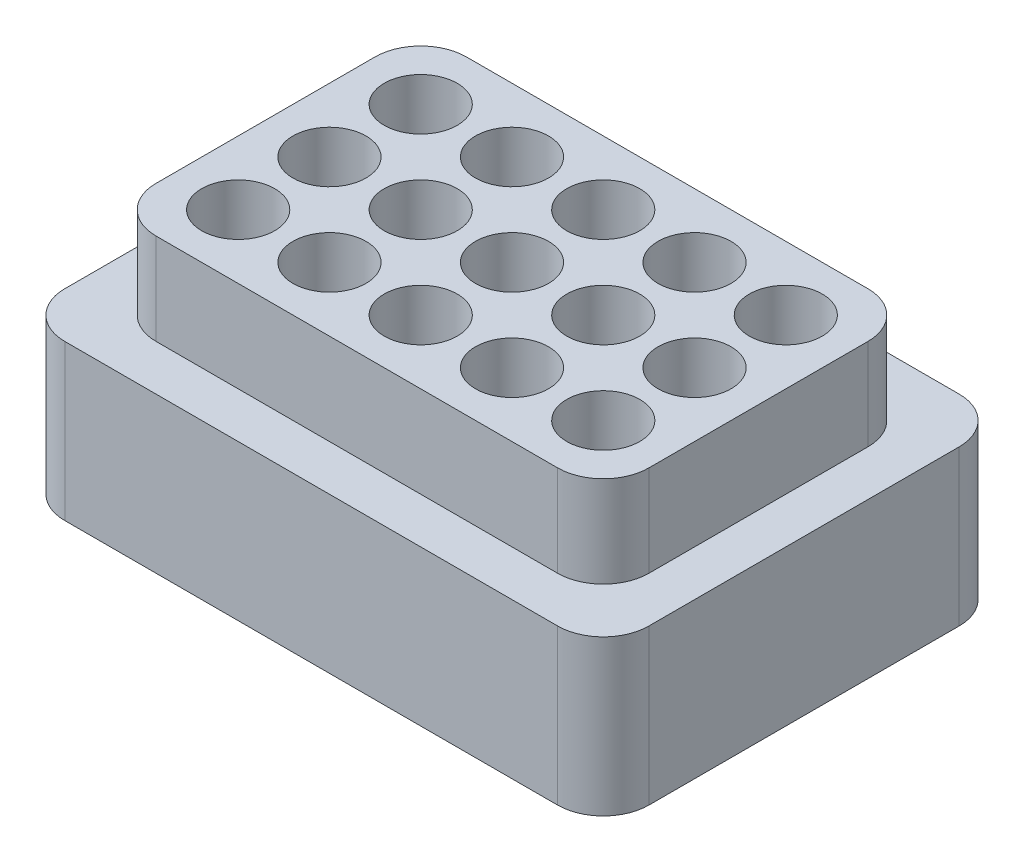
ISO-10303-21;
HEADER;
FILE_DESCRIPTION(('STEP AP214'),'2;1');
FILE_NAME('part.step','',(''),(''),'','','');
FILE_SCHEMA(('AUTOMOTIVE_DESIGN { 1 0 10303 214 1 1 1 1 }'));
ENDSEC;
DATA;
#1=APPLICATION_CONTEXT('core data for automotive mechanical design processes');
#2=APPLICATION_PROTOCOL_DEFINITION('international standard','automotive_design',2000,#1);
#3=PRODUCT_CONTEXT('',#1,'mechanical');
#4=PRODUCT('Part','Part','',(#3));
#5=PRODUCT_RELATED_PRODUCT_CATEGORY('part','',(#4));
#6=PRODUCT_DEFINITION_FORMATION('','',#4);
#7=PRODUCT_DEFINITION_CONTEXT('part definition',#1,'design');
#8=PRODUCT_DEFINITION('design','',#6,#7);
#9=PRODUCT_DEFINITION_SHAPE('','',#8);
#10=(LENGTH_UNIT() NAMED_UNIT(*) SI_UNIT(.MILLI.,.METRE.));
#11=(NAMED_UNIT(*) PLANE_ANGLE_UNIT() SI_UNIT($,.RADIAN.));
#12=(NAMED_UNIT(*) SI_UNIT($,.STERADIAN.) SOLID_ANGLE_UNIT());
#13=UNCERTAINTY_MEASURE_WITH_UNIT(LENGTH_MEASURE(1.E-05),#10,'distance_accuracy_value','');
#14=(GEOMETRIC_REPRESENTATION_CONTEXT(3) GLOBAL_UNCERTAINTY_ASSIGNED_CONTEXT((#13)) GLOBAL_UNIT_ASSIGNED_CONTEXT((#10,
#11,#12)) REPRESENTATION_CONTEXT('',''));
#15=CARTESIAN_POINT('',(0.,0.,0.));
#16=DIRECTION('',(0.,0.,1.));
#17=DIRECTION('',(1.,0.,0.));
#18=AXIS2_PLACEMENT_3D('',#15,#16,#17);
#19=CARTESIAN_POINT('',(0.,25.,0.));
#20=DIRECTION('',(0.,1.,0.));
#21=DIRECTION('',(0.,0.,1.));
#22=AXIS2_PLACEMENT_3D('',#19,#20,#21);
#23=PLANE('',#22);
#24=CARTESIAN_POINT('',(-16.8143652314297,25.,11.2679047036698));
#25=DIRECTION('',(0.,1.,0.));
#26=DIRECTION('',(0.,0.,1.));
#27=AXIS2_PLACEMENT_3D('',#24,#25,#26);
#28=CIRCLE('',#27,4.);
#29=CARTESIAN_POINT('',(-16.8143652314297,25.,15.2679047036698));
#30=VERTEX_POINT('',#29);
#31=EDGE_CURVE('E286',#30,#30,#28,.T.);
#32=ORIENTED_EDGE('',*,*,#31,.F.);
#33=EDGE_LOOP('',(#32));
#34=FACE_BOUND('',#33,.T.);
#35=CARTESIAN_POINT('',(23.1856347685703,25.,11.2679047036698));
#36=DIRECTION('',(0.,1.,0.));
#37=DIRECTION('',(0.,0.,1.));
#38=AXIS2_PLACEMENT_3D('',#35,#36,#37);
#39=CIRCLE('',#38,4.);
#40=CARTESIAN_POINT('',(23.1856347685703,25.,15.2679047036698));
#41=VERTEX_POINT('',#40);
#42=EDGE_CURVE('E298',#41,#41,#39,.T.);
#43=ORIENTED_EDGE('',*,*,#42,.F.);
#44=EDGE_LOOP('',(#43));
#45=FACE_BOUND('',#44,.T.);
#46=CARTESIAN_POINT('',(3.18563476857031,25.,11.2679047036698));
#47=DIRECTION('',(0.,1.,0.));
#48=DIRECTION('',(0.,0.,1.));
#49=AXIS2_PLACEMENT_3D('',#46,#47,#48);
#50=CIRCLE('',#49,4.);
#51=CARTESIAN_POINT('',(3.18563476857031,25.,15.2679047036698));
#52=VERTEX_POINT('',#51);
#53=EDGE_CURVE('E310',#52,#52,#50,.T.);
#54=ORIENTED_EDGE('',*,*,#53,.F.);
#55=EDGE_LOOP('',(#54));
#56=FACE_BOUND('',#55,.T.);
#57=CARTESIAN_POINT('',(23.1856347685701,25.,1.26790470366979));
#58=DIRECTION('',(0.,1.,0.));
#59=DIRECTION('',(0.,0.,1.));
#60=AXIS2_PLACEMENT_3D('',#57,#58,#59);
#61=CIRCLE('',#60,4.);
#62=CARTESIAN_POINT('',(23.1856347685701,25.,5.26790470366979));
#63=VERTEX_POINT('',#62);
#64=EDGE_CURVE('E322',#63,#63,#61,.T.);
#65=ORIENTED_EDGE('',*,*,#64,.F.);
#66=EDGE_LOOP('',(#65));
#67=FACE_BOUND('',#66,.T.);
#68=CARTESIAN_POINT('',(3.18563476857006,25.,1.26790470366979));
#69=DIRECTION('',(0.,1.,0.));
#70=DIRECTION('',(0.,0.,1.));
#71=AXIS2_PLACEMENT_3D('',#68,#69,#70);
#72=CIRCLE('',#71,4.);
#73=CARTESIAN_POINT('',(3.18563476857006,25.,5.26790470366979));
#74=VERTEX_POINT('',#73);
#75=EDGE_CURVE('E334',#74,#74,#72,.T.);
#76=ORIENTED_EDGE('',*,*,#75,.F.);
#77=EDGE_LOOP('',(#76));
#78=FACE_BOUND('',#77,.T.);
#79=CARTESIAN_POINT('',(23.1856347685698,25.,-8.73209529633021));
#80=DIRECTION('',(0.,1.,0.));
#81=DIRECTION('',(0.,0.,1.));
#82=AXIS2_PLACEMENT_3D('',#79,#80,#81);
#83=CIRCLE('',#82,4.);
#84=CARTESIAN_POINT('',(23.1856347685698,25.,-4.73209529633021));
#85=VERTEX_POINT('',#84);
#86=EDGE_CURVE('E346',#85,#85,#83,.T.);
#87=ORIENTED_EDGE('',*,*,#86,.F.);
#88=EDGE_LOOP('',(#87));
#89=FACE_BOUND('',#88,.T.);
#90=CARTESIAN_POINT('',(3.18563476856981,25.,-8.73209529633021));
#91=DIRECTION('',(0.,1.,0.));
#92=DIRECTION('',(0.,0.,1.));
#93=AXIS2_PLACEMENT_3D('',#90,#91,#92);
#94=CIRCLE('',#93,4.);
#95=CARTESIAN_POINT('',(3.18563476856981,25.,-4.73209529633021));
#96=VERTEX_POINT('',#95);
#97=EDGE_CURVE('E358',#96,#96,#94,.T.);
#98=ORIENTED_EDGE('',*,*,#97,.F.);
#99=EDGE_LOOP('',(#98));
#100=FACE_BOUND('',#99,.T.);
#101=CARTESIAN_POINT('',(-16.8143652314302,25.,-8.73209529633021));
#102=DIRECTION('',(0.,1.,0.));
#103=DIRECTION('',(0.,0.,1.));
#104=AXIS2_PLACEMENT_3D('',#101,#102,#103);
#105=CIRCLE('',#104,4.);
#106=CARTESIAN_POINT('',(-16.8143652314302,25.,-4.73209529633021));
#107=VERTEX_POINT('',#106);
#108=EDGE_CURVE('E178',#107,#107,#105,.T.);
#109=ORIENTED_EDGE('',*,*,#108,.F.);
#110=EDGE_LOOP('',(#109));
#111=FACE_BOUND('',#110,.T.);
#112=CARTESIAN_POINT('',(-6.81436523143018,25.,-8.73209529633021));
#113=DIRECTION('',(0.,1.,0.));
#114=DIRECTION('',(0.,0.,1.));
#115=AXIS2_PLACEMENT_3D('',#112,#113,#114);
#116=CIRCLE('',#115,4.);
#117=CARTESIAN_POINT('',(-6.81436523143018,25.,-4.73209529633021));
#118=VERTEX_POINT('',#117);
#119=EDGE_CURVE('E364',#118,#118,#116,.T.);
#120=ORIENTED_EDGE('',*,*,#119,.F.);
#121=EDGE_LOOP('',(#120));
#122=FACE_BOUND('',#121,.T.);
#123=CARTESIAN_POINT('',(13.1856347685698,25.,-8.73209529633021));
#124=DIRECTION('',(0.,1.,0.));
#125=DIRECTION('',(0.,0.,1.));
#126=AXIS2_PLACEMENT_3D('',#123,#124,#125);
#127=CIRCLE('',#126,4.);
#128=CARTESIAN_POINT('',(13.1856347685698,25.,-4.73209529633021));
#129=VERTEX_POINT('',#128);
#130=EDGE_CURVE('E352',#129,#129,#127,.T.);
#131=ORIENTED_EDGE('',*,*,#130,.F.);
#132=EDGE_LOOP('',(#131));
#133=FACE_BOUND('',#132,.T.);
#134=CARTESIAN_POINT('',(-6.81436523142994,25.,1.26790470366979));
#135=DIRECTION('',(0.,1.,0.));
#136=DIRECTION('',(0.,0.,1.));
#137=AXIS2_PLACEMENT_3D('',#134,#135,#136);
#138=CIRCLE('',#137,4.);
#139=CARTESIAN_POINT('',(-6.81436523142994,25.,5.26790470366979));
#140=VERTEX_POINT('',#139);
#141=EDGE_CURVE('E340',#140,#140,#138,.T.);
#142=ORIENTED_EDGE('',*,*,#141,.F.);
#143=EDGE_LOOP('',(#142));
#144=FACE_BOUND('',#143,.T.);
#145=CARTESIAN_POINT('',(13.1856347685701,25.,1.26790470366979));
#146=DIRECTION('',(0.,1.,0.));
#147=DIRECTION('',(0.,0.,1.));
#148=AXIS2_PLACEMENT_3D('',#145,#146,#147);
#149=CIRCLE('',#148,4.);
#150=CARTESIAN_POINT('',(13.1856347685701,25.,5.26790470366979));
#151=VERTEX_POINT('',#150);
#152=EDGE_CURVE('E328',#151,#151,#149,.T.);
#153=ORIENTED_EDGE('',*,*,#152,.F.);
#154=EDGE_LOOP('',(#153));
#155=FACE_BOUND('',#154,.T.);
#156=CARTESIAN_POINT('',(-6.81436523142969,25.,11.2679047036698));
#157=DIRECTION('',(0.,1.,0.));
#158=DIRECTION('',(0.,0.,1.));
#159=AXIS2_PLACEMENT_3D('',#156,#157,#158);
#160=CIRCLE('',#159,4.);
#161=CARTESIAN_POINT('',(-6.81436523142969,25.,15.2679047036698));
#162=VERTEX_POINT('',#161);
#163=EDGE_CURVE('E316',#162,#162,#160,.T.);
#164=ORIENTED_EDGE('',*,*,#163,.F.);
#165=EDGE_LOOP('',(#164));
#166=FACE_BOUND('',#165,.T.);
#167=CARTESIAN_POINT('',(13.1856347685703,25.,11.2679047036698));
#168=DIRECTION('',(0.,1.,0.));
#169=DIRECTION('',(0.,0.,1.));
#170=AXIS2_PLACEMENT_3D('',#167,#168,#169);
#171=CIRCLE('',#170,4.);
#172=CARTESIAN_POINT('',(13.1856347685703,25.,15.2679047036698));
#173=VERTEX_POINT('',#172);
#174=EDGE_CURVE('E304',#173,#173,#171,.T.);
#175=ORIENTED_EDGE('',*,*,#174,.F.);
#176=EDGE_LOOP('',(#175));
#177=FACE_BOUND('',#176,.T.);
#178=CARTESIAN_POINT('',(-16.8143652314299,25.,1.26790470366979));
#179=DIRECTION('',(0.,1.,0.));
#180=DIRECTION('',(0.,0.,1.));
#181=AXIS2_PLACEMENT_3D('',#178,#179,#180);
#182=CIRCLE('',#181,4.);
#183=CARTESIAN_POINT('',(-16.8143652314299,25.,5.26790470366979));
#184=VERTEX_POINT('',#183);
#185=EDGE_CURVE('E292',#184,#184,#182,.T.);
#186=ORIENTED_EDGE('',*,*,#185,.F.);
#187=EDGE_LOOP('',(#186));
#188=FACE_BOUND('',#187,.T.);
#189=DIRECTION('',(-1.,0.,0.));
#190=VECTOR('',#189,1.);
#191=CARTESIAN_POINT('',(30.1856347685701,25.,-15.7320952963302));
#192=LINE('',#191,#190);
#193=CARTESIAN_POINT('',(25.1856347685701,25.,-15.7320952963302));
#194=VERTEX_POINT('',#193);
#195=CARTESIAN_POINT('',(-18.8143652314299,25.,-15.7320952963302));
#196=VERTEX_POINT('',#195);
#197=EDGE_CURVE('E251',#194,#196,#192,.T.);
#198=ORIENTED_EDGE('',*,*,#197,.T.);
#199=CARTESIAN_POINT('',(-18.8143652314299,25.,-10.7320952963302));
#200=DIRECTION('',(0.,1.,0.));
#201=DIRECTION('',(0.,0.,1.));
#202=AXIS2_PLACEMENT_3D('',#199,#200,#201);
#203=CIRCLE('',#202,5.);
#204=CARTESIAN_POINT('',(-23.8143652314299,25.,-10.7320952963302));
#205=VERTEX_POINT('',#204);
#206=EDGE_CURVE('E204',#196,#205,#203,.T.);
#207=ORIENTED_EDGE('',*,*,#206,.T.);
#208=DIRECTION('',(0.,0.,1.));
#209=VECTOR('',#208,1.);
#210=CARTESIAN_POINT('',(-23.8143652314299,25.,-15.7320952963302));
#211=LINE('',#210,#209);
#212=CARTESIAN_POINT('',(-23.8143652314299,25.,13.2679047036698));
#213=VERTEX_POINT('',#212);
#214=EDGE_CURVE('E257',#205,#213,#211,.T.);
#215=ORIENTED_EDGE('',*,*,#214,.T.);
#216=CARTESIAN_POINT('',(-18.8143652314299,25.,13.2679047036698));
#217=DIRECTION('',(0.,1.,0.));
#218=DIRECTION('',(0.,0.,1.));
#219=AXIS2_PLACEMENT_3D('',#216,#217,#218);
#220=CIRCLE('',#219,5.);
#221=CARTESIAN_POINT('',(-18.8143652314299,25.,18.2679047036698));
#222=VERTEX_POINT('',#221);
#223=EDGE_CURVE('E201',#213,#222,#220,.T.);
#224=ORIENTED_EDGE('',*,*,#223,.T.);
#225=DIRECTION('',(1.,0.,0.));
#226=VECTOR('',#225,1.);
#227=CARTESIAN_POINT('',(-23.8143652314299,25.,18.2679047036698));
#228=LINE('',#227,#226);
#229=CARTESIAN_POINT('',(25.1856347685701,25.,18.2679047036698));
#230=VERTEX_POINT('',#229);
#231=EDGE_CURVE('E256',#222,#230,#228,.T.);
#232=ORIENTED_EDGE('',*,*,#231,.T.);
#233=CARTESIAN_POINT('',(25.1856347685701,25.,13.2679047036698));
#234=DIRECTION('',(0.,1.,0.));
#235=DIRECTION('',(0.,0.,1.));
#236=AXIS2_PLACEMENT_3D('',#233,#234,#235);
#237=CIRCLE('',#236,5.);
#238=CARTESIAN_POINT('',(30.1856347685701,25.,13.2679047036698));
#239=VERTEX_POINT('',#238);
#240=EDGE_CURVE('E56',#230,#239,#237,.T.);
#241=ORIENTED_EDGE('',*,*,#240,.T.);
#242=DIRECTION('',(0.,0.,-1.));
#243=VECTOR('',#242,1.);
#244=CARTESIAN_POINT('',(30.1856347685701,25.,18.2679047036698));
#245=LINE('',#244,#243);
#246=CARTESIAN_POINT('',(30.1856347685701,25.,-10.7320952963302));
#247=VERTEX_POINT('',#246);
#248=EDGE_CURVE('E261',#239,#247,#245,.T.);
#249=ORIENTED_EDGE('',*,*,#248,.T.);
#250=CARTESIAN_POINT('',(25.1856347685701,25.,-10.7320952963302));
#251=DIRECTION('',(0.,1.,0.));
#252=DIRECTION('',(0.,0.,1.));
#253=AXIS2_PLACEMENT_3D('',#250,#251,#252);
#254=CIRCLE('',#253,5.);
#255=EDGE_CURVE('E48',#247,#194,#254,.T.);
#256=ORIENTED_EDGE('',*,*,#255,.T.);
#257=EDGE_LOOP('',(#198,#207,#215,#224,#232,#241,#249,#256));
#258=FACE_BOUND('',#257,.T.);
#259=ADVANCED_FACE('F33',(#34,#45,#56,#67,#78,#89,#100,#111,#122,#133,#144,#155,#166,#177,#188,
#258),#23,.T.);
#260=CARTESIAN_POINT('',(-16.8143652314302,25.,-8.73209529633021));
#261=DIRECTION('',(0.,-1.,0.));
#262=DIRECTION('',(0.,0.,-1.));
#263=AXIS2_PLACEMENT_3D('',#260,#261,#262);
#264=CYLINDRICAL_SURFACE('',#263,4.);
#265=ORIENTED_EDGE('',*,*,#108,.T.);
#266=EDGE_LOOP('',(#265));
#267=FACE_BOUND('',#266,.T.);
#268=CARTESIAN_POINT('',(-16.8143652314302,0.,-8.73209529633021));
#269=DIRECTION('',(0.,1.,0.));
#270=DIRECTION('',(0.,0.,1.));
#271=AXIS2_PLACEMENT_3D('',#268,#269,#270);
#272=CIRCLE('',#271,4.);
#273=CARTESIAN_POINT('',(-16.8143652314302,0.,-4.73209529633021));
#274=VERTEX_POINT('',#273);
#275=EDGE_CURVE('E367',#274,#274,#272,.T.);
#276=ORIENTED_EDGE('',*,*,#275,.F.);
#277=EDGE_LOOP('',(#276));
#278=FACE_BOUND('',#277,.T.);
#279=ADVANCED_FACE('F376',(#267,#278),#264,.F.);
#280=CARTESIAN_POINT('',(-6.81436523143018,25.,-8.73209529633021));
#281=DIRECTION('',(0.,-1.,0.));
#282=DIRECTION('',(0.,0.,-1.));
#283=AXIS2_PLACEMENT_3D('',#280,#281,#282);
#284=CYLINDRICAL_SURFACE('',#283,4.);
#285=ORIENTED_EDGE('',*,*,#119,.T.);
#286=EDGE_LOOP('',(#285));
#287=FACE_BOUND('',#286,.T.);
#288=CARTESIAN_POINT('',(-6.81436523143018,0.,-8.73209529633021));
#289=DIRECTION('',(0.,1.,0.));
#290=DIRECTION('',(0.,0.,1.));
#291=AXIS2_PLACEMENT_3D('',#288,#289,#290);
#292=CIRCLE('',#291,4.);
#293=CARTESIAN_POINT('',(-6.81436523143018,0.,-4.73209529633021));
#294=VERTEX_POINT('',#293);
#295=EDGE_CURVE('E361',#294,#294,#292,.T.);
#296=ORIENTED_EDGE('',*,*,#295,.F.);
#297=EDGE_LOOP('',(#296));
#298=FACE_BOUND('',#297,.T.);
#299=ADVANCED_FACE('F378',(#287,#298),#284,.F.);
#300=CARTESIAN_POINT('',(3.18563476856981,25.,-8.73209529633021));
#301=DIRECTION('',(0.,-1.,0.));
#302=DIRECTION('',(0.,0.,-1.));
#303=AXIS2_PLACEMENT_3D('',#300,#301,#302);
#304=CYLINDRICAL_SURFACE('',#303,4.);
#305=ORIENTED_EDGE('',*,*,#97,.T.);
#306=EDGE_LOOP('',(#305));
#307=FACE_BOUND('',#306,.T.);
#308=CARTESIAN_POINT('',(3.18563476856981,0.,-8.73209529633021));
#309=DIRECTION('',(0.,1.,0.));
#310=DIRECTION('',(0.,0.,1.));
#311=AXIS2_PLACEMENT_3D('',#308,#309,#310);
#312=CIRCLE('',#311,4.);
#313=CARTESIAN_POINT('',(3.18563476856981,0.,-4.73209529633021));
#314=VERTEX_POINT('',#313);
#315=EDGE_CURVE('E355',#314,#314,#312,.T.);
#316=ORIENTED_EDGE('',*,*,#315,.F.);
#317=EDGE_LOOP('',(#316));
#318=FACE_BOUND('',#317,.T.);
#319=ADVANCED_FACE('F385',(#307,#318),#304,.F.);
#320=CARTESIAN_POINT('',(13.1856347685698,25.,-8.73209529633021));
#321=DIRECTION('',(0.,-1.,0.));
#322=DIRECTION('',(0.,0.,-1.));
#323=AXIS2_PLACEMENT_3D('',#320,#321,#322);
#324=CYLINDRICAL_SURFACE('',#323,4.);
#325=ORIENTED_EDGE('',*,*,#130,.T.);
#326=EDGE_LOOP('',(#325));
#327=FACE_BOUND('',#326,.T.);
#328=CARTESIAN_POINT('',(13.1856347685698,0.,-8.73209529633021));
#329=DIRECTION('',(0.,1.,0.));
#330=DIRECTION('',(0.,0.,1.));
#331=AXIS2_PLACEMENT_3D('',#328,#329,#330);
#332=CIRCLE('',#331,4.);
#333=CARTESIAN_POINT('',(13.1856347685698,0.,-4.73209529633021));
#334=VERTEX_POINT('',#333);
#335=EDGE_CURVE('E349',#334,#334,#332,.T.);
#336=ORIENTED_EDGE('',*,*,#335,.F.);
#337=EDGE_LOOP('',(#336));
#338=FACE_BOUND('',#337,.T.);
#339=ADVANCED_FACE('F502',(#327,#338),#324,.F.);
#340=CARTESIAN_POINT('',(23.1856347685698,25.,-8.73209529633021));
#341=DIRECTION('',(0.,-1.,0.));
#342=DIRECTION('',(0.,0.,-1.));
#343=AXIS2_PLACEMENT_3D('',#340,#341,#342);
#344=CYLINDRICAL_SURFACE('',#343,4.);
#345=ORIENTED_EDGE('',*,*,#86,.T.);
#346=EDGE_LOOP('',(#345));
#347=FACE_BOUND('',#346,.T.);
#348=CARTESIAN_POINT('',(23.1856347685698,0.,-8.73209529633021));
#349=DIRECTION('',(0.,1.,0.));
#350=DIRECTION('',(0.,0.,1.));
#351=AXIS2_PLACEMENT_3D('',#348,#349,#350);
#352=CIRCLE('',#351,4.);
#353=CARTESIAN_POINT('',(23.1856347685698,0.,-4.73209529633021));
#354=VERTEX_POINT('',#353);
#355=EDGE_CURVE('E343',#354,#354,#352,.T.);
#356=ORIENTED_EDGE('',*,*,#355,.F.);
#357=EDGE_LOOP('',(#356));
#358=FACE_BOUND('',#357,.T.);
#359=ADVANCED_FACE('F498',(#347,#358),#344,.F.);
#360=CARTESIAN_POINT('',(-6.81436523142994,25.,1.26790470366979));
#361=DIRECTION('',(0.,-1.,0.));
#362=DIRECTION('',(0.,0.,-1.));
#363=AXIS2_PLACEMENT_3D('',#360,#361,#362);
#364=CYLINDRICAL_SURFACE('',#363,4.);
#365=ORIENTED_EDGE('',*,*,#141,.T.);
#366=EDGE_LOOP('',(#365));
#367=FACE_BOUND('',#366,.T.);
#368=CARTESIAN_POINT('',(-6.81436523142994,0.,1.26790470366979));
#369=DIRECTION('',(0.,1.,0.));
#370=DIRECTION('',(0.,0.,1.));
#371=AXIS2_PLACEMENT_3D('',#368,#369,#370);
#372=CIRCLE('',#371,4.);
#373=CARTESIAN_POINT('',(-6.81436523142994,0.,5.26790470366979));
#374=VERTEX_POINT('',#373);
#375=EDGE_CURVE('E337',#374,#374,#372,.T.);
#376=ORIENTED_EDGE('',*,*,#375,.F.);
#377=EDGE_LOOP('',(#376));
#378=FACE_BOUND('',#377,.T.);
#379=ADVANCED_FACE('F494',(#367,#378),#364,.F.);
#380=CARTESIAN_POINT('',(3.18563476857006,25.,1.26790470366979));
#381=DIRECTION('',(0.,-1.,0.));
#382=DIRECTION('',(0.,0.,-1.));
#383=AXIS2_PLACEMENT_3D('',#380,#381,#382);
#384=CYLINDRICAL_SURFACE('',#383,4.);
#385=ORIENTED_EDGE('',*,*,#75,.T.);
#386=EDGE_LOOP('',(#385));
#387=FACE_BOUND('',#386,.T.);
#388=CARTESIAN_POINT('',(3.18563476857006,0.,1.26790470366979));
#389=DIRECTION('',(0.,1.,0.));
#390=DIRECTION('',(0.,0.,1.));
#391=AXIS2_PLACEMENT_3D('',#388,#389,#390);
#392=CIRCLE('',#391,4.);
#393=CARTESIAN_POINT('',(3.18563476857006,0.,5.26790470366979));
#394=VERTEX_POINT('',#393);
#395=EDGE_CURVE('E331',#394,#394,#392,.T.);
#396=ORIENTED_EDGE('',*,*,#395,.F.);
#397=EDGE_LOOP('',(#396));
#398=FACE_BOUND('',#397,.T.);
#399=ADVANCED_FACE('F490',(#387,#398),#384,.F.);
#400=CARTESIAN_POINT('',(13.1856347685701,25.,1.26790470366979));
#401=DIRECTION('',(0.,-1.,0.));
#402=DIRECTION('',(0.,0.,-1.));
#403=AXIS2_PLACEMENT_3D('',#400,#401,#402);
#404=CYLINDRICAL_SURFACE('',#403,4.);
#405=ORIENTED_EDGE('',*,*,#152,.T.);
#406=EDGE_LOOP('',(#405));
#407=FACE_BOUND('',#406,.T.);
#408=CARTESIAN_POINT('',(13.1856347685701,0.,1.26790470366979));
#409=DIRECTION('',(0.,1.,0.));
#410=DIRECTION('',(0.,0.,1.));
#411=AXIS2_PLACEMENT_3D('',#408,#409,#410);
#412=CIRCLE('',#411,4.);
#413=CARTESIAN_POINT('',(13.1856347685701,0.,5.26790470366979));
#414=VERTEX_POINT('',#413);
#415=EDGE_CURVE('E325',#414,#414,#412,.T.);
#416=ORIENTED_EDGE('',*,*,#415,.F.);
#417=EDGE_LOOP('',(#416));
#418=FACE_BOUND('',#417,.T.);
#419=ADVANCED_FACE('F486',(#407,#418),#404,.F.);
#420=CARTESIAN_POINT('',(23.1856347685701,25.,1.26790470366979));
#421=DIRECTION('',(0.,-1.,0.));
#422=DIRECTION('',(0.,0.,-1.));
#423=AXIS2_PLACEMENT_3D('',#420,#421,#422);
#424=CYLINDRICAL_SURFACE('',#423,4.);
#425=ORIENTED_EDGE('',*,*,#64,.T.);
#426=EDGE_LOOP('',(#425));
#427=FACE_BOUND('',#426,.T.);
#428=CARTESIAN_POINT('',(23.1856347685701,0.,1.26790470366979));
#429=DIRECTION('',(0.,1.,0.));
#430=DIRECTION('',(0.,0.,1.));
#431=AXIS2_PLACEMENT_3D('',#428,#429,#430);
#432=CIRCLE('',#431,4.);
#433=CARTESIAN_POINT('',(23.1856347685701,0.,5.26790470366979));
#434=VERTEX_POINT('',#433);
#435=EDGE_CURVE('E319',#434,#434,#432,.T.);
#436=ORIENTED_EDGE('',*,*,#435,.F.);
#437=EDGE_LOOP('',(#436));
#438=FACE_BOUND('',#437,.T.);
#439=ADVANCED_FACE('F482',(#427,#438),#424,.F.);
#440=CARTESIAN_POINT('',(-6.81436523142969,25.,11.2679047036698));
#441=DIRECTION('',(0.,-1.,0.));
#442=DIRECTION('',(0.,0.,-1.));
#443=AXIS2_PLACEMENT_3D('',#440,#441,#442);
#444=CYLINDRICAL_SURFACE('',#443,4.);
#445=ORIENTED_EDGE('',*,*,#163,.T.);
#446=EDGE_LOOP('',(#445));
#447=FACE_BOUND('',#446,.T.);
#448=CARTESIAN_POINT('',(-6.81436523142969,0.,11.2679047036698));
#449=DIRECTION('',(0.,1.,0.));
#450=DIRECTION('',(0.,0.,1.));
#451=AXIS2_PLACEMENT_3D('',#448,#449,#450);
#452=CIRCLE('',#451,4.);
#453=CARTESIAN_POINT('',(-6.81436523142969,0.,15.2679047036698));
#454=VERTEX_POINT('',#453);
#455=EDGE_CURVE('E313',#454,#454,#452,.T.);
#456=ORIENTED_EDGE('',*,*,#455,.F.);
#457=EDGE_LOOP('',(#456));
#458=FACE_BOUND('',#457,.T.);
#459=ADVANCED_FACE('F478',(#447,#458),#444,.F.);
#460=CARTESIAN_POINT('',(3.18563476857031,25.,11.2679047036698));
#461=DIRECTION('',(0.,-1.,0.));
#462=DIRECTION('',(0.,0.,-1.));
#463=AXIS2_PLACEMENT_3D('',#460,#461,#462);
#464=CYLINDRICAL_SURFACE('',#463,4.);
#465=ORIENTED_EDGE('',*,*,#53,.T.);
#466=EDGE_LOOP('',(#465));
#467=FACE_BOUND('',#466,.T.);
#468=CARTESIAN_POINT('',(3.18563476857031,0.,11.2679047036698));
#469=DIRECTION('',(0.,1.,0.));
#470=DIRECTION('',(0.,0.,1.));
#471=AXIS2_PLACEMENT_3D('',#468,#469,#470);
#472=CIRCLE('',#471,4.);
#473=CARTESIAN_POINT('',(3.18563476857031,0.,15.2679047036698));
#474=VERTEX_POINT('',#473);
#475=EDGE_CURVE('E307',#474,#474,#472,.T.);
#476=ORIENTED_EDGE('',*,*,#475,.F.);
#477=EDGE_LOOP('',(#476));
#478=FACE_BOUND('',#477,.T.);
#479=ADVANCED_FACE('F474',(#467,#478),#464,.F.);
#480=CARTESIAN_POINT('',(13.1856347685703,25.,11.2679047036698));
#481=DIRECTION('',(0.,-1.,0.));
#482=DIRECTION('',(0.,0.,-1.));
#483=AXIS2_PLACEMENT_3D('',#480,#481,#482);
#484=CYLINDRICAL_SURFACE('',#483,4.);
#485=ORIENTED_EDGE('',*,*,#174,.T.);
#486=EDGE_LOOP('',(#485));
#487=FACE_BOUND('',#486,.T.);
#488=CARTESIAN_POINT('',(13.1856347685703,0.,11.2679047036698));
#489=DIRECTION('',(0.,1.,0.));
#490=DIRECTION('',(0.,0.,1.));
#491=AXIS2_PLACEMENT_3D('',#488,#489,#490);
#492=CIRCLE('',#491,4.);
#493=CARTESIAN_POINT('',(13.1856347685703,0.,15.2679047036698));
#494=VERTEX_POINT('',#493);
#495=EDGE_CURVE('E301',#494,#494,#492,.T.);
#496=ORIENTED_EDGE('',*,*,#495,.F.);
#497=EDGE_LOOP('',(#496));
#498=FACE_BOUND('',#497,.T.);
#499=ADVANCED_FACE('F470',(#487,#498),#484,.F.);
#500=CARTESIAN_POINT('',(23.1856347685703,25.,11.2679047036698));
#501=DIRECTION('',(0.,-1.,0.));
#502=DIRECTION('',(0.,0.,-1.));
#503=AXIS2_PLACEMENT_3D('',#500,#501,#502);
#504=CYLINDRICAL_SURFACE('',#503,4.);
#505=ORIENTED_EDGE('',*,*,#42,.T.);
#506=EDGE_LOOP('',(#505));
#507=FACE_BOUND('',#506,.T.);
#508=CARTESIAN_POINT('',(23.1856347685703,0.,11.2679047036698));
#509=DIRECTION('',(0.,1.,0.));
#510=DIRECTION('',(0.,0.,1.));
#511=AXIS2_PLACEMENT_3D('',#508,#509,#510);
#512=CIRCLE('',#511,4.);
#513=CARTESIAN_POINT('',(23.1856347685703,0.,15.2679047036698));
#514=VERTEX_POINT('',#513);
#515=EDGE_CURVE('E295',#514,#514,#512,.T.);
#516=ORIENTED_EDGE('',*,*,#515,.F.);
#517=EDGE_LOOP('',(#516));
#518=FACE_BOUND('',#517,.T.);
#519=ADVANCED_FACE('F466',(#507,#518),#504,.F.);
#520=CARTESIAN_POINT('',(-16.8143652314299,25.,1.26790470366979));
#521=DIRECTION('',(0.,-1.,0.));
#522=DIRECTION('',(0.,0.,-1.));
#523=AXIS2_PLACEMENT_3D('',#520,#521,#522);
#524=CYLINDRICAL_SURFACE('',#523,4.);
#525=ORIENTED_EDGE('',*,*,#185,.T.);
#526=EDGE_LOOP('',(#525));
#527=FACE_BOUND('',#526,.T.);
#528=CARTESIAN_POINT('',(-16.8143652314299,0.,1.26790470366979));
#529=DIRECTION('',(0.,1.,0.));
#530=DIRECTION('',(0.,0.,1.));
#531=AXIS2_PLACEMENT_3D('',#528,#529,#530);
#532=CIRCLE('',#531,4.);
#533=CARTESIAN_POINT('',(-16.8143652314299,0.,5.26790470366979));
#534=VERTEX_POINT('',#533);
#535=EDGE_CURVE('E289',#534,#534,#532,.T.);
#536=ORIENTED_EDGE('',*,*,#535,.F.);
#537=EDGE_LOOP('',(#536));
#538=FACE_BOUND('',#537,.T.);
#539=ADVANCED_FACE('F462',(#527,#538),#524,.F.);
#540=CARTESIAN_POINT('',(-16.8143652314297,25.,11.2679047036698));
#541=DIRECTION('',(0.,-1.,0.));
#542=DIRECTION('',(0.,0.,-1.));
#543=AXIS2_PLACEMENT_3D('',#540,#541,#542);
#544=CYLINDRICAL_SURFACE('',#543,4.);
#545=ORIENTED_EDGE('',*,*,#31,.T.);
#546=EDGE_LOOP('',(#545));
#547=FACE_BOUND('',#546,.T.);
#548=CARTESIAN_POINT('',(-16.8143652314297,0.,11.2679047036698));
#549=DIRECTION('',(0.,1.,0.));
#550=DIRECTION('',(0.,0.,1.));
#551=AXIS2_PLACEMENT_3D('',#548,#549,#550);
#552=CIRCLE('',#551,4.);
#553=CARTESIAN_POINT('',(-16.8143652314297,0.,15.2679047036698));
#554=VERTEX_POINT('',#553);
#555=EDGE_CURVE('E285',#554,#554,#552,.T.);
#556=ORIENTED_EDGE('',*,*,#555,.F.);
#557=EDGE_LOOP('',(#556));
#558=FACE_BOUND('',#557,.T.);
#559=ADVANCED_FACE('F459',(#547,#558),#544,.F.);
#560=CARTESIAN_POINT('',(0.,0.,0.));
#561=DIRECTION('',(0.,1.,0.));
#562=DIRECTION('',(0.,0.,1.));
#563=AXIS2_PLACEMENT_3D('',#560,#561,#562);
#564=PLANE('',#563);
#565=ORIENTED_EDGE('',*,*,#555,.T.);
#566=EDGE_LOOP('',(#565));
#567=FACE_BOUND('',#566,.T.);
#568=ADVANCED_FACE('F458',(#567),#564,.T.);
#569=ORIENTED_EDGE('',*,*,#535,.T.);
#570=EDGE_LOOP('',(#569));
#571=FACE_BOUND('',#570,.T.);
#572=ADVANCED_FACE('F583',(#571),#564,.T.);
#573=ORIENTED_EDGE('',*,*,#515,.T.);
#574=EDGE_LOOP('',(#573));
#575=FACE_BOUND('',#574,.T.);
#576=ADVANCED_FACE('F576',(#575),#564,.T.);
#577=ORIENTED_EDGE('',*,*,#495,.T.);
#578=EDGE_LOOP('',(#577));
#579=FACE_BOUND('',#578,.T.);
#580=ADVANCED_FACE('F569',(#579),#564,.T.);
#581=ORIENTED_EDGE('',*,*,#475,.T.);
#582=EDGE_LOOP('',(#581));
#583=FACE_BOUND('',#582,.T.);
#584=ADVANCED_FACE('F562',(#583),#564,.T.);
#585=ORIENTED_EDGE('',*,*,#455,.T.);
#586=EDGE_LOOP('',(#585));
#587=FACE_BOUND('',#586,.T.);
#588=ADVANCED_FACE('F555',(#587),#564,.T.);
#589=ORIENTED_EDGE('',*,*,#435,.T.);
#590=EDGE_LOOP('',(#589));
#591=FACE_BOUND('',#590,.T.);
#592=ADVANCED_FACE('F548',(#591),#564,.T.);
#593=ORIENTED_EDGE('',*,*,#415,.T.);
#594=EDGE_LOOP('',(#593));
#595=FACE_BOUND('',#594,.T.);
#596=ADVANCED_FACE('F541',(#595),#564,.T.);
#597=ORIENTED_EDGE('',*,*,#395,.T.);
#598=EDGE_LOOP('',(#597));
#599=FACE_BOUND('',#598,.T.);
#600=ADVANCED_FACE('F534',(#599),#564,.T.);
#601=ORIENTED_EDGE('',*,*,#375,.T.);
#602=EDGE_LOOP('',(#601));
#603=FACE_BOUND('',#602,.T.);
#604=ADVANCED_FACE('F527',(#603),#564,.T.);
#605=ORIENTED_EDGE('',*,*,#355,.T.);
#606=EDGE_LOOP('',(#605));
#607=FACE_BOUND('',#606,.T.);
#608=ADVANCED_FACE('F522',(#607),#564,.T.);
#609=ORIENTED_EDGE('',*,*,#335,.T.);
#610=EDGE_LOOP('',(#609));
#611=FACE_BOUND('',#610,.T.);
#612=ADVANCED_FACE('F516',(#611),#564,.T.);
#613=ORIENTED_EDGE('',*,*,#315,.T.);
#614=EDGE_LOOP('',(#613));
#615=FACE_BOUND('',#614,.T.);
#616=ADVANCED_FACE('F514',(#615),#564,.T.);
#617=ORIENTED_EDGE('',*,*,#295,.T.);
#618=EDGE_LOOP('',(#617));
#619=FACE_BOUND('',#618,.T.);
#620=ADVANCED_FACE('F457',(#619),#564,.T.);
#621=ORIENTED_EDGE('',*,*,#275,.T.);
#622=EDGE_LOOP('',(#621));
#623=FACE_BOUND('',#622,.T.);
#624=ADVANCED_FACE('F374',(#623),#564,.T.);
#625=CARTESIAN_POINT('',(0.,15.,0.));
#626=DIRECTION('',(0.,1.,0.));
#627=DIRECTION('',(0.,0.,1.));
#628=AXIS2_PLACEMENT_3D('',#625,#626,#627);
#629=PLANE('',#628);
#630=DIRECTION('',(-1.,0.,0.));
#631=VECTOR('',#630,1.);
#632=CARTESIAN_POINT('',(30.1856347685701,15.,-15.7320952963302));
#633=LINE('',#632,#631);
#634=CARTESIAN_POINT('',(25.1856347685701,15.,-15.7320952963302));
#635=VERTEX_POINT('',#634);
#636=CARTESIAN_POINT('',(-18.8143652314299,15.,-15.7320952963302));
#637=VERTEX_POINT('',#636);
#638=EDGE_CURVE('E170',#635,#637,#633,.T.);
#639=ORIENTED_EDGE('',*,*,#638,.F.);
#640=CARTESIAN_POINT('',(25.1856347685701,15.,-10.7320952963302));
#641=DIRECTION('',(0.,1.,0.));
#642=DIRECTION('',(0.,0.,1.));
#643=AXIS2_PLACEMENT_3D('',#640,#641,#642);
#644=CIRCLE('',#643,5.);
#645=CARTESIAN_POINT('',(30.1856347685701,15.,-10.7320952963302));
#646=VERTEX_POINT('',#645);
#647=EDGE_CURVE('E232',#635,#646,#644,.F.);
#648=ORIENTED_EDGE('',*,*,#647,.T.);
#649=DIRECTION('',(0.,0.,-1.));
#650=VECTOR('',#649,1.);
#651=CARTESIAN_POINT('',(30.1856347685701,15.,18.2679047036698));
#652=LINE('',#651,#650);
#653=CARTESIAN_POINT('',(30.1856347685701,15.,13.2679047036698));
#654=VERTEX_POINT('',#653);
#655=EDGE_CURVE('E885',#654,#646,#652,.T.);
#656=ORIENTED_EDGE('',*,*,#655,.F.);
#657=CARTESIAN_POINT('',(25.1856347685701,15.,13.2679047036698));
#658=DIRECTION('',(0.,1.,0.));
#659=DIRECTION('',(0.,0.,1.));
#660=AXIS2_PLACEMENT_3D('',#657,#658,#659);
#661=CIRCLE('',#660,5.);
#662=CARTESIAN_POINT('',(25.1856347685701,15.,18.2679047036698));
#663=VERTEX_POINT('',#662);
#664=EDGE_CURVE('E11',#654,#663,#661,.F.);
#665=ORIENTED_EDGE('',*,*,#664,.T.);
#666=DIRECTION('',(1.,0.,0.));
#667=VECTOR('',#666,1.);
#668=CARTESIAN_POINT('',(-23.8143652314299,15.,18.2679047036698));
#669=LINE('',#668,#667);
#670=CARTESIAN_POINT('',(-18.8143652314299,15.,18.2679047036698));
#671=VERTEX_POINT('',#670);
#672=EDGE_CURVE('E242',#671,#663,#669,.T.);
#673=ORIENTED_EDGE('',*,*,#672,.F.);
#674=CARTESIAN_POINT('',(-18.8143652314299,15.,13.2679047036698));
#675=DIRECTION('',(0.,1.,0.));
#676=DIRECTION('',(0.,0.,1.));
#677=AXIS2_PLACEMENT_3D('',#674,#675,#676);
#678=CIRCLE('',#677,5.);
#679=CARTESIAN_POINT('',(-23.8143652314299,15.,13.2679047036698));
#680=VERTEX_POINT('',#679);
#681=EDGE_CURVE('E41',#671,#680,#678,.F.);
#682=ORIENTED_EDGE('',*,*,#681,.T.);
#683=DIRECTION('',(0.,0.,1.));
#684=VECTOR('',#683,1.);
#685=CARTESIAN_POINT('',(-23.8143652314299,15.,-15.7320952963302));
#686=LINE('',#685,#684);
#687=CARTESIAN_POINT('',(-23.8143652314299,15.,-10.7320952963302));
#688=VERTEX_POINT('',#687);
#689=EDGE_CURVE('E239',#688,#680,#686,.T.);
#690=ORIENTED_EDGE('',*,*,#689,.F.);
#691=CARTESIAN_POINT('',(-18.8143652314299,15.,-10.7320952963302));
#692=DIRECTION('',(0.,1.,0.));
#693=DIRECTION('',(0.,0.,1.));
#694=AXIS2_PLACEMENT_3D('',#691,#692,#693);
#695=CIRCLE('',#694,5.);
#696=EDGE_CURVE('E230',#688,#637,#695,.F.);
#697=ORIENTED_EDGE('',*,*,#696,.T.);
#698=EDGE_LOOP('',(#639,#648,#656,#665,#673,#682,#690,#697));
#699=FACE_BOUND('',#698,.T.);
#700=DIRECTION('',(-1.,0.,0.));
#701=VECTOR('',#700,1.);
#702=CARTESIAN_POINT('',(35.1856347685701,15.,-20.7320952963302));
#703=LINE('',#702,#701);
#704=CARTESIAN_POINT('',(30.1856347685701,15.,-20.7320952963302));
#705=VERTEX_POINT('',#704);
#706=CARTESIAN_POINT('',(-23.8143652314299,15.,-20.7320952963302));
#707=VERTEX_POINT('',#706);
#708=EDGE_CURVE('E154',#705,#707,#703,.T.);
#709=ORIENTED_EDGE('',*,*,#708,.T.);
#710=CARTESIAN_POINT('',(-23.8143652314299,15.,-15.7320952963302));
#711=DIRECTION('',(0.,1.,0.));
#712=DIRECTION('',(0.,0.,1.));
#713=AXIS2_PLACEMENT_3D('',#710,#711,#712);
#714=CIRCLE('',#713,5.);
#715=CARTESIAN_POINT('',(-28.8143652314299,15.,-15.7320952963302));
#716=VERTEX_POINT('',#715);
#717=EDGE_CURVE('E148',#707,#716,#714,.T.);
#718=ORIENTED_EDGE('',*,*,#717,.T.);
#719=DIRECTION('',(0.,0.,1.));
#720=VECTOR('',#719,1.);
#721=CARTESIAN_POINT('',(-28.8143652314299,15.,-20.7320952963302));
#722=LINE('',#721,#720);
#723=CARTESIAN_POINT('',(-28.8143652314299,15.,18.2679047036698));
#724=VERTEX_POINT('',#723);
#725=EDGE_CURVE('E151',#716,#724,#722,.T.);
#726=ORIENTED_EDGE('',*,*,#725,.T.);
#727=CARTESIAN_POINT('',(-23.8143652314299,15.,18.2679047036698));
#728=DIRECTION('',(0.,1.,0.));
#729=DIRECTION('',(0.,0.,1.));
#730=AXIS2_PLACEMENT_3D('',#727,#728,#729);
#731=CIRCLE('',#730,5.);
#732=CARTESIAN_POINT('',(-23.8143652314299,15.,23.2679047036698));
#733=VERTEX_POINT('',#732);
#734=EDGE_CURVE('E159',#724,#733,#731,.T.);
#735=ORIENTED_EDGE('',*,*,#734,.T.);
#736=DIRECTION('',(1.,0.,0.));
#737=VECTOR('',#736,1.);
#738=CARTESIAN_POINT('',(-28.8143652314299,15.,23.2679047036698));
#739=LINE('',#738,#737);
#740=CARTESIAN_POINT('',(30.1856347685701,15.,23.2679047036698));
#741=VERTEX_POINT('',#740);
#742=EDGE_CURVE('E169',#733,#741,#739,.T.);
#743=ORIENTED_EDGE('',*,*,#742,.T.);
#744=CARTESIAN_POINT('',(30.1856347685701,15.,18.2679047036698));
#745=DIRECTION('',(0.,1.,0.));
#746=DIRECTION('',(0.,0.,1.));
#747=AXIS2_PLACEMENT_3D('',#744,#745,#746);
#748=CIRCLE('',#747,5.);
#749=CARTESIAN_POINT('',(35.1856347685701,15.,18.2679047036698));
#750=VERTEX_POINT('',#749);
#751=EDGE_CURVE('E191',#741,#750,#748,.T.);
#752=ORIENTED_EDGE('',*,*,#751,.T.);
#753=DIRECTION('',(0.,0.,-1.));
#754=VECTOR('',#753,1.);
#755=CARTESIAN_POINT('',(35.1856347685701,15.,23.2679047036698));
#756=LINE('',#755,#754);
#757=CARTESIAN_POINT('',(35.1856347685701,15.,-15.7320952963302));
#758=VERTEX_POINT('',#757);
#759=EDGE_CURVE('E270',#750,#758,#756,.T.);
#760=ORIENTED_EDGE('',*,*,#759,.T.);
#761=CARTESIAN_POINT('',(30.1856347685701,15.,-15.7320952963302));
#762=DIRECTION('',(0.,1.,0.));
#763=DIRECTION('',(0.,0.,1.));
#764=AXIS2_PLACEMENT_3D('',#761,#762,#763);
#765=CIRCLE('',#764,5.);
#766=EDGE_CURVE('E193',#758,#705,#765,.T.);
#767=ORIENTED_EDGE('',*,*,#766,.T.);
#768=EDGE_LOOP('',(#709,#718,#726,#735,#743,#752,#760,#767));
#769=FACE_BOUND('',#768,.T.);
#770=ADVANCED_FACE('F150',(#699,#769),#629,.T.);
#771=CARTESIAN_POINT('',(-23.8143652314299,15.,-15.7320952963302));
#772=DIRECTION('',(-1.,0.,0.));
#773=DIRECTION('',(0.,0.,1.));
#774=AXIS2_PLACEMENT_3D('',#771,#772,#773);
#775=PLANE('',#774);
#776=ORIENTED_EDGE('',*,*,#214,.F.);
#777=DIRECTION('',(0.,1.,0.));
#778=VECTOR('',#777,1.);
#779=CARTESIAN_POINT('',(-23.8143652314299,15.,-10.7320952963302));
#780=LINE('',#779,#778);
#781=EDGE_CURVE('E209',#205,#688,#780,.F.);
#782=ORIENTED_EDGE('',*,*,#781,.T.);
#783=ORIENTED_EDGE('',*,*,#689,.T.);
#784=DIRECTION('',(0.,1.,0.));
#785=VECTOR('',#784,1.);
#786=CARTESIAN_POINT('',(-23.8143652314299,15.,13.2679047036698));
#787=LINE('',#786,#785);
#788=EDGE_CURVE('E206',#680,#213,#787,.T.);
#789=ORIENTED_EDGE('',*,*,#788,.T.);
#790=EDGE_LOOP('',(#776,#782,#783,#789));
#791=FACE_BOUND('',#790,.T.);
#792=ADVANCED_FACE('F248',(#791),#775,.T.);
#793=CARTESIAN_POINT('',(30.1856347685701,15.,-15.7320952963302));
#794=DIRECTION('',(0.,0.,-1.));
#795=DIRECTION('',(-1.,0.,0.));
#796=AXIS2_PLACEMENT_3D('',#793,#794,#795);
#797=PLANE('',#796);
#798=ORIENTED_EDGE('',*,*,#638,.T.);
#799=DIRECTION('',(0.,1.,0.));
#800=VECTOR('',#799,1.);
#801=CARTESIAN_POINT('',(-18.8143652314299,15.,-15.7320952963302));
#802=LINE('',#801,#800);
#803=EDGE_CURVE('E197',#637,#196,#802,.T.);
#804=ORIENTED_EDGE('',*,*,#803,.T.);
#805=ORIENTED_EDGE('',*,*,#197,.F.);
#806=DIRECTION('',(0.,1.,0.));
#807=VECTOR('',#806,1.);
#808=CARTESIAN_POINT('',(25.1856347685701,15.,-15.7320952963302));
#809=LINE('',#808,#807);
#810=EDGE_CURVE('E158',#194,#635,#809,.F.);
#811=ORIENTED_EDGE('',*,*,#810,.T.);
#812=EDGE_LOOP('',(#798,#804,#805,#811));
#813=FACE_BOUND('',#812,.T.);
#814=ADVANCED_FACE('F806',(#813),#797,.T.);
#815=CARTESIAN_POINT('',(30.1856347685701,15.,18.2679047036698));
#816=DIRECTION('',(1.,0.,0.));
#817=DIRECTION('',(0.,0.,-1.));
#818=AXIS2_PLACEMENT_3D('',#815,#816,#817);
#819=PLANE('',#818);
#820=ORIENTED_EDGE('',*,*,#655,.T.);
#821=DIRECTION('',(0.,1.,0.));
#822=VECTOR('',#821,1.);
#823=CARTESIAN_POINT('',(30.1856347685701,15.,-10.7320952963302));
#824=LINE('',#823,#822);
#825=EDGE_CURVE('E213',#646,#247,#824,.T.);
#826=ORIENTED_EDGE('',*,*,#825,.T.);
#827=ORIENTED_EDGE('',*,*,#248,.F.);
#828=DIRECTION('',(0.,1.,0.));
#829=VECTOR('',#828,1.);
#830=CARTESIAN_POINT('',(30.1856347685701,15.,13.2679047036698));
#831=LINE('',#830,#829);
#832=EDGE_CURVE('E211',#239,#654,#831,.F.);
#833=ORIENTED_EDGE('',*,*,#832,.T.);
#834=EDGE_LOOP('',(#820,#826,#827,#833));
#835=FACE_BOUND('',#834,.T.);
#836=ADVANCED_FACE('F450',(#835),#819,.T.);
#837=CARTESIAN_POINT('',(-23.8143652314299,15.,18.2679047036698));
#838=DIRECTION('',(0.,0.,1.));
#839=DIRECTION('',(1.,0.,0.));
#840=AXIS2_PLACEMENT_3D('',#837,#838,#839);
#841=PLANE('',#840);
#842=ORIENTED_EDGE('',*,*,#231,.F.);
#843=DIRECTION('',(0.,1.,0.));
#844=VECTOR('',#843,1.);
#845=CARTESIAN_POINT('',(-18.8143652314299,15.,18.2679047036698));
#846=LINE('',#845,#844);
#847=EDGE_CURVE('E218',#222,#671,#846,.F.);
#848=ORIENTED_EDGE('',*,*,#847,.T.);
#849=ORIENTED_EDGE('',*,*,#672,.T.);
#850=DIRECTION('',(0.,1.,0.));
#851=VECTOR('',#850,1.);
#852=CARTESIAN_POINT('',(25.1856347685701,15.,18.2679047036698));
#853=LINE('',#852,#851);
#854=EDGE_CURVE('E215',#663,#230,#853,.T.);
#855=ORIENTED_EDGE('',*,*,#854,.T.);
#856=EDGE_LOOP('',(#842,#848,#849,#855));
#857=FACE_BOUND('',#856,.T.);
#858=ADVANCED_FACE('F259',(#857),#841,.T.);
#859=CARTESIAN_POINT('',(0.,-2.,0.));
#860=DIRECTION('',(0.,1.,0.));
#861=DIRECTION('',(0.,0.,1.));
#862=AXIS2_PLACEMENT_3D('',#859,#860,#861);
#863=PLANE('',#862);
#864=DIRECTION('',(0.,0.,-1.));
#865=VECTOR('',#864,1.);
#866=CARTESIAN_POINT('',(-28.8143652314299,-2.,-20.7320952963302));
#867=LINE('',#866,#865);
#868=CARTESIAN_POINT('',(-28.8143652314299,-2.,18.2679047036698));
#869=VERTEX_POINT('',#868);
#870=CARTESIAN_POINT('',(-28.8143652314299,-2.,-15.7320952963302));
#871=VERTEX_POINT('',#870);
#872=EDGE_CURVE('E277',#869,#871,#867,.T.);
#873=ORIENTED_EDGE('',*,*,#872,.T.);
#874=CARTESIAN_POINT('',(-23.8143652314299,-2.,-15.7320952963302));
#875=DIRECTION('',(0.,1.,0.));
#876=DIRECTION('',(0.,0.,1.));
#877=AXIS2_PLACEMENT_3D('',#874,#875,#876);
#878=CIRCLE('',#877,5.);
#879=CARTESIAN_POINT('',(-23.8143652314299,-2.,-20.7320952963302));
#880=VERTEX_POINT('',#879);
#881=EDGE_CURVE('E173',#871,#880,#878,.F.);
#882=ORIENTED_EDGE('',*,*,#881,.T.);
#883=DIRECTION('',(1.,0.,0.));
#884=VECTOR('',#883,1.);
#885=CARTESIAN_POINT('',(35.1856347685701,-2.,-20.7320952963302));
#886=LINE('',#885,#884);
#887=CARTESIAN_POINT('',(30.1856347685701,-2.,-20.7320952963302));
#888=VERTEX_POINT('',#887);
#889=EDGE_CURVE('E279',#880,#888,#886,.T.);
#890=ORIENTED_EDGE('',*,*,#889,.T.);
#891=CARTESIAN_POINT('',(30.1856347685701,-2.,-15.7320952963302));
#892=DIRECTION('',(0.,1.,0.));
#893=DIRECTION('',(0.,0.,1.));
#894=AXIS2_PLACEMENT_3D('',#891,#892,#893);
#895=CIRCLE('',#894,5.);
#896=CARTESIAN_POINT('',(35.1856347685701,-2.,-15.7320952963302));
#897=VERTEX_POINT('',#896);
#898=EDGE_CURVE('E176',#888,#897,#895,.F.);
#899=ORIENTED_EDGE('',*,*,#898,.T.);
#900=DIRECTION('',(0.,0.,1.));
#901=VECTOR('',#900,1.);
#902=CARTESIAN_POINT('',(35.1856347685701,-2.,23.2679047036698));
#903=LINE('',#902,#901);
#904=CARTESIAN_POINT('',(35.1856347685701,-2.,18.2679047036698));
#905=VERTEX_POINT('',#904);
#906=EDGE_CURVE('E282',#897,#905,#903,.T.);
#907=ORIENTED_EDGE('',*,*,#906,.T.);
#908=CARTESIAN_POINT('',(30.1856347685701,-2.,18.2679047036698));
#909=DIRECTION('',(0.,1.,0.));
#910=DIRECTION('',(0.,0.,1.));
#911=AXIS2_PLACEMENT_3D('',#908,#909,#910);
#912=CIRCLE('',#911,5.);
#913=CARTESIAN_POINT('',(30.1856347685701,-2.,23.2679047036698));
#914=VERTEX_POINT('',#913);
#915=EDGE_CURVE('E174',#905,#914,#912,.F.);
#916=ORIENTED_EDGE('',*,*,#915,.T.);
#917=DIRECTION('',(-1.,0.,0.));
#918=VECTOR('',#917,1.);
#919=CARTESIAN_POINT('',(-28.8143652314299,-2.,23.2679047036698));
#920=LINE('',#919,#918);
#921=CARTESIAN_POINT('',(-23.8143652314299,-2.,23.2679047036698));
#922=VERTEX_POINT('',#921);
#923=EDGE_CURVE('E274',#914,#922,#920,.T.);
#924=ORIENTED_EDGE('',*,*,#923,.T.);
#925=CARTESIAN_POINT('',(-23.8143652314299,-2.,18.2679047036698));
#926=DIRECTION('',(0.,1.,0.));
#927=DIRECTION('',(0.,0.,1.));
#928=AXIS2_PLACEMENT_3D('',#925,#926,#927);
#929=CIRCLE('',#928,5.);
#930=EDGE_CURVE('E183',#922,#869,#929,.F.);
#931=ORIENTED_EDGE('',*,*,#930,.T.);
#932=EDGE_LOOP('',(#873,#882,#890,#899,#907,#916,#924,#931));
#933=FACE_BOUND('',#932,.T.);
#934=ADVANCED_FACE('F395',(#933),#863,.F.);
#935=CARTESIAN_POINT('',(-28.8143652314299,25.,23.2679047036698));
#936=DIRECTION('',(0.,0.,-1.));
#937=DIRECTION('',(-1.,0.,0.));
#938=AXIS2_PLACEMENT_3D('',#935,#936,#937);
#939=PLANE('',#938);
#940=ORIENTED_EDGE('',*,*,#742,.F.);
#941=DIRECTION('',(0.,-1.,0.));
#942=VECTOR('',#941,1.);
#943=CARTESIAN_POINT('',(-23.8143652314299,25.,23.2679047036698));
#944=LINE('',#943,#942);
#945=EDGE_CURVE('E222',#733,#922,#944,.T.);
#946=ORIENTED_EDGE('',*,*,#945,.T.);
#947=ORIENTED_EDGE('',*,*,#923,.F.);
#948=DIRECTION('',(0.,-1.,0.));
#949=VECTOR('',#948,1.);
#950=CARTESIAN_POINT('',(30.1856347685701,25.,23.2679047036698));
#951=LINE('',#950,#949);
#952=EDGE_CURVE('E220',#914,#741,#951,.F.);
#953=ORIENTED_EDGE('',*,*,#952,.T.);
#954=EDGE_LOOP('',(#940,#946,#947,#953));
#955=FACE_BOUND('',#954,.T.);
#956=ADVANCED_FACE('F392',(#955),#939,.F.);
#957=CARTESIAN_POINT('',(-28.8143652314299,25.,-20.7320952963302));
#958=DIRECTION('',(1.,0.,0.));
#959=DIRECTION('',(0.,0.,-1.));
#960=AXIS2_PLACEMENT_3D('',#957,#958,#959);
#961=PLANE('',#960);
#962=ORIENTED_EDGE('',*,*,#725,.F.);
#963=DIRECTION('',(0.,-1.,0.));
#964=VECTOR('',#963,1.);
#965=CARTESIAN_POINT('',(-28.8143652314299,25.,-15.7320952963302));
#966=LINE('',#965,#964);
#967=EDGE_CURVE('E165',#716,#871,#966,.T.);
#968=ORIENTED_EDGE('',*,*,#967,.T.);
#969=ORIENTED_EDGE('',*,*,#872,.F.);
#970=DIRECTION('',(0.,-1.,0.));
#971=VECTOR('',#970,1.);
#972=CARTESIAN_POINT('',(-28.8143652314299,25.,18.2679047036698));
#973=LINE('',#972,#971);
#974=EDGE_CURVE('E168',#869,#724,#973,.F.);
#975=ORIENTED_EDGE('',*,*,#974,.T.);
#976=EDGE_LOOP('',(#962,#968,#969,#975));
#977=FACE_BOUND('',#976,.T.);
#978=ADVANCED_FACE('F163',(#977),#961,.F.);
#979=CARTESIAN_POINT('',(-28.8143652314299,25.,-20.7320952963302));
#980=DIRECTION('',(0.,0.,1.));
#981=DIRECTION('',(1.,0.,0.));
#982=AXIS2_PLACEMENT_3D('',#979,#980,#981);
#983=PLANE('',#982);
#984=ORIENTED_EDGE('',*,*,#889,.F.);
#985=DIRECTION('',(0.,-1.,0.));
#986=VECTOR('',#985,1.);
#987=CARTESIAN_POINT('',(-23.8143652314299,25.,-20.7320952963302));
#988=LINE('',#987,#986);
#989=EDGE_CURVE('E189',#880,#707,#988,.F.);
#990=ORIENTED_EDGE('',*,*,#989,.T.);
#991=ORIENTED_EDGE('',*,*,#708,.F.);
#992=DIRECTION('',(0.,-1.,0.));
#993=VECTOR('',#992,1.);
#994=CARTESIAN_POINT('',(30.1856347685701,25.,-20.7320952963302));
#995=LINE('',#994,#993);
#996=EDGE_CURVE('E186',#705,#888,#995,.T.);
#997=ORIENTED_EDGE('',*,*,#996,.T.);
#998=EDGE_LOOP('',(#984,#990,#991,#997));
#999=FACE_BOUND('',#998,.T.);
#1000=ADVANCED_FACE('F399',(#999),#983,.F.);
#1001=CARTESIAN_POINT('',(35.1856347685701,25.,-20.7320952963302));
#1002=DIRECTION('',(-1.,0.,0.));
#1003=DIRECTION('',(0.,0.,1.));
#1004=AXIS2_PLACEMENT_3D('',#1001,#1002,#1003);
#1005=PLANE('',#1004);
#1006=ORIENTED_EDGE('',*,*,#906,.F.);
#1007=DIRECTION('',(0.,-1.,0.));
#1008=VECTOR('',#1007,1.);
#1009=CARTESIAN_POINT('',(35.1856347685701,25.,-15.7320952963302));
#1010=LINE('',#1009,#1008);
#1011=EDGE_CURVE('E228',#897,#758,#1010,.F.);
#1012=ORIENTED_EDGE('',*,*,#1011,.T.);
#1013=ORIENTED_EDGE('',*,*,#759,.F.);
#1014=DIRECTION('',(0.,-1.,0.));
#1015=VECTOR('',#1014,1.);
#1016=CARTESIAN_POINT('',(35.1856347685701,25.,18.2679047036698));
#1017=LINE('',#1016,#1015);
#1018=EDGE_CURVE('E225',#750,#905,#1017,.T.);
#1019=ORIENTED_EDGE('',*,*,#1018,.T.);
#1020=EDGE_LOOP('',(#1006,#1012,#1013,#1019));
#1021=FACE_BOUND('',#1020,.T.);
#1022=ADVANCED_FACE('F402',(#1021),#1005,.F.);
#1023=CARTESIAN_POINT('',(-23.8143652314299,25.,-15.7320952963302));
#1024=DIRECTION('',(0.,-1.,0.));
#1025=DIRECTION('',(0.,0.,-1.));
#1026=AXIS2_PLACEMENT_3D('',#1023,#1024,#1025);
#1027=CYLINDRICAL_SURFACE('',#1026,5.);
#1028=ORIENTED_EDGE('',*,*,#717,.F.);
#1029=ORIENTED_EDGE('',*,*,#989,.F.);
#1030=ORIENTED_EDGE('',*,*,#881,.F.);
#1031=ORIENTED_EDGE('',*,*,#967,.F.);
#1032=EDGE_LOOP('',(#1028,#1029,#1030,#1031));
#1033=FACE_BOUND('',#1032,.T.);
#1034=ADVANCED_FACE('F172',(#1033),#1027,.T.);
#1035=CARTESIAN_POINT('',(-18.8143652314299,15.,-10.7320952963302));
#1036=DIRECTION('',(0.,1.,0.));
#1037=DIRECTION('',(0.,0.,1.));
#1038=AXIS2_PLACEMENT_3D('',#1035,#1036,#1037);
#1039=CYLINDRICAL_SURFACE('',#1038,5.);
#1040=ORIENTED_EDGE('',*,*,#696,.F.);
#1041=ORIENTED_EDGE('',*,*,#781,.F.);
#1042=ORIENTED_EDGE('',*,*,#206,.F.);
#1043=ORIENTED_EDGE('',*,*,#803,.F.);
#1044=EDGE_LOOP('',(#1040,#1041,#1042,#1043));
#1045=FACE_BOUND('',#1044,.T.);
#1046=ADVANCED_FACE('F409',(#1045),#1039,.T.);
#1047=CARTESIAN_POINT('',(25.1856347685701,15.,-10.7320952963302));
#1048=DIRECTION('',(0.,1.,0.));
#1049=DIRECTION('',(0.,0.,1.));
#1050=AXIS2_PLACEMENT_3D('',#1047,#1048,#1049);
#1051=CYLINDRICAL_SURFACE('',#1050,5.);
#1052=ORIENTED_EDGE('',*,*,#647,.F.);
#1053=ORIENTED_EDGE('',*,*,#810,.F.);
#1054=ORIENTED_EDGE('',*,*,#255,.F.);
#1055=ORIENTED_EDGE('',*,*,#825,.F.);
#1056=EDGE_LOOP('',(#1052,#1053,#1054,#1055));
#1057=FACE_BOUND('',#1056,.T.);
#1058=ADVANCED_FACE('F412',(#1057),#1051,.T.);
#1059=CARTESIAN_POINT('',(-18.8143652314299,15.,13.2679047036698));
#1060=DIRECTION('',(0.,1.,0.));
#1061=DIRECTION('',(0.,0.,1.));
#1062=AXIS2_PLACEMENT_3D('',#1059,#1060,#1061);
#1063=CYLINDRICAL_SURFACE('',#1062,5.);
#1064=ORIENTED_EDGE('',*,*,#681,.F.);
#1065=ORIENTED_EDGE('',*,*,#847,.F.);
#1066=ORIENTED_EDGE('',*,*,#223,.F.);
#1067=ORIENTED_EDGE('',*,*,#788,.F.);
#1068=EDGE_LOOP('',(#1064,#1065,#1066,#1067));
#1069=FACE_BOUND('',#1068,.T.);
#1070=ADVANCED_FACE('F253',(#1069),#1063,.T.);
#1071=CARTESIAN_POINT('',(-23.8143652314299,25.,18.2679047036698));
#1072=DIRECTION('',(0.,-1.,0.));
#1073=DIRECTION('',(0.,0.,-1.));
#1074=AXIS2_PLACEMENT_3D('',#1071,#1072,#1073);
#1075=CYLINDRICAL_SURFACE('',#1074,5.);
#1076=ORIENTED_EDGE('',*,*,#734,.F.);
#1077=ORIENTED_EDGE('',*,*,#974,.F.);
#1078=ORIENTED_EDGE('',*,*,#930,.F.);
#1079=ORIENTED_EDGE('',*,*,#945,.F.);
#1080=EDGE_LOOP('',(#1076,#1077,#1078,#1079));
#1081=FACE_BOUND('',#1080,.T.);
#1082=ADVANCED_FACE('F418',(#1081),#1075,.T.);
#1083=CARTESIAN_POINT('',(30.1856347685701,25.,-15.7320952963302));
#1084=DIRECTION('',(0.,-1.,0.));
#1085=DIRECTION('',(0.,0.,-1.));
#1086=AXIS2_PLACEMENT_3D('',#1083,#1084,#1085);
#1087=CYLINDRICAL_SURFACE('',#1086,5.);
#1088=ORIENTED_EDGE('',*,*,#766,.F.);
#1089=ORIENTED_EDGE('',*,*,#1011,.F.);
#1090=ORIENTED_EDGE('',*,*,#898,.F.);
#1091=ORIENTED_EDGE('',*,*,#996,.F.);
#1092=EDGE_LOOP('',(#1088,#1089,#1090,#1091));
#1093=FACE_BOUND('',#1092,.T.);
#1094=ADVANCED_FACE('F421',(#1093),#1087,.T.);
#1095=CARTESIAN_POINT('',(30.1856347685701,25.,18.2679047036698));
#1096=DIRECTION('',(0.,-1.,0.));
#1097=DIRECTION('',(0.,0.,-1.));
#1098=AXIS2_PLACEMENT_3D('',#1095,#1096,#1097);
#1099=CYLINDRICAL_SURFACE('',#1098,5.);
#1100=ORIENTED_EDGE('',*,*,#751,.F.);
#1101=ORIENTED_EDGE('',*,*,#952,.F.);
#1102=ORIENTED_EDGE('',*,*,#915,.F.);
#1103=ORIENTED_EDGE('',*,*,#1018,.F.);
#1104=EDGE_LOOP('',(#1100,#1101,#1102,#1103));
#1105=FACE_BOUND('',#1104,.T.);
#1106=ADVANCED_FACE('F424',(#1105),#1099,.T.);
#1107=CARTESIAN_POINT('',(25.1856347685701,15.,13.2679047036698));
#1108=DIRECTION('',(0.,1.,0.));
#1109=DIRECTION('',(0.,0.,1.));
#1110=AXIS2_PLACEMENT_3D('',#1107,#1108,#1109);
#1111=CYLINDRICAL_SURFACE('',#1110,5.);
#1112=ORIENTED_EDGE('',*,*,#664,.F.);
#1113=ORIENTED_EDGE('',*,*,#832,.F.);
#1114=ORIENTED_EDGE('',*,*,#240,.F.);
#1115=ORIENTED_EDGE('',*,*,#854,.F.);
#1116=EDGE_LOOP('',(#1112,#1113,#1114,#1115));
#1117=FACE_BOUND('',#1116,.T.);
#1118=ADVANCED_FACE('F35',(#1117),#1111,.T.);
#1119=CLOSED_SHELL('',(#259,#279,#299,#319,#339,#359,#379,#399,#419,#439,#459,#479,#499,#519,
#539,#559,#568,#572,#576,#580,#584,#588,#592,#596,#600,#604,#608,#612,#616,#620,#624,#770,#792,
#814,#836,#858,#934,#956,#978,#1000,#1022,#1034,#1046,#1058,#1070,#1082,#1094,#1106,#1118));
#1120=MANIFOLD_SOLID_BREP('B2',#1119);
#1121=ADVANCED_BREP_SHAPE_REPRESENTATION('',(#18,#1120),#14);
#1122=SHAPE_DEFINITION_REPRESENTATION(#9,#1121);
ENDSEC;
END-ISO-10303-21;
